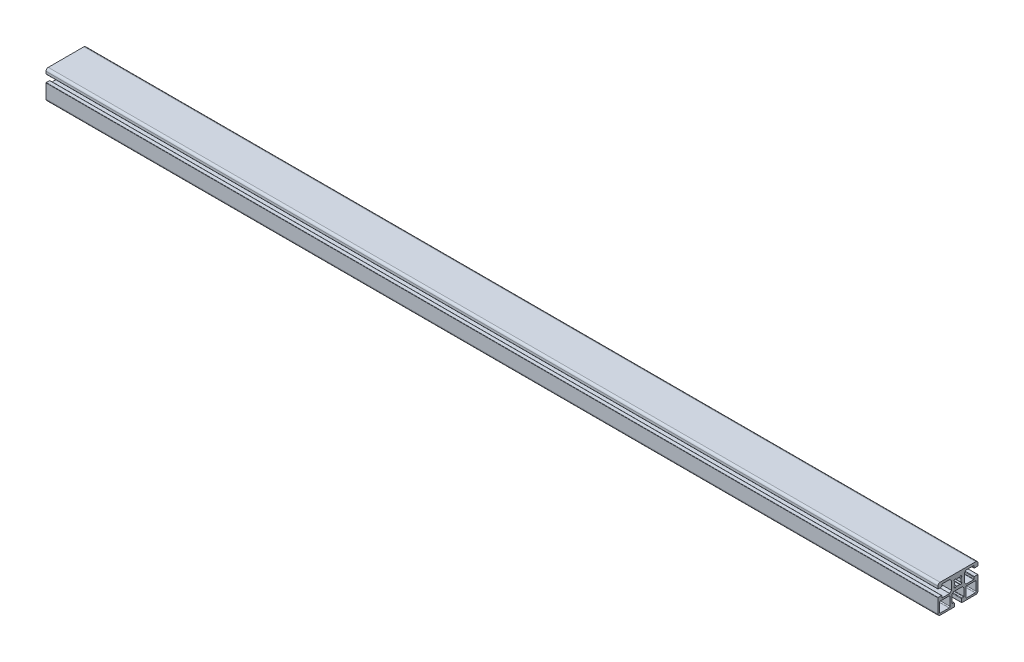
from build123d import *

# Parameters (mm, degrees)
F_45_SARJA_1_0072_ALUMIINIPROFIILI_45X32_L_DEPTH = 1000


with BuildPart() as part:
    # Sketch12 → 45-sarja 1.0072 ALUMIINIPROFIILI 45X32 L (new body)
    with BuildSketch(Plane(origin=(0, 0, 0), x_dir=(0, 0, -1), z_dir=(1, 0, 0))):
        with BuildLine():
            Line((18.763883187, 10.40208761), (22.463883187, 10.40208761))
            ThreePointArc((22.463883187, 10.40208761), (22.676015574, 10.489955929), (22.763883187, 10.70208861))
            Line((22.763883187, 10.70208861), (22.763883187, 13.30208761))
            ThreePointArc((22.763883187, 13.30208761), (22.03165014, 15.069854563), (20.263883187, 15.80208761))
            Line((20.263883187, 15.80208761), (-19.736116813, 15.80208761))
            ThreePointArc((-19.736116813, 15.80208761), (-21.503883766, 15.069854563), (-22.236116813, 13.30208761))
            Line((-22.236116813, 13.30208761), (-22.236116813, 10.70208761))
            ThreePointArc((-22.236116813, 10.70208761), (-22.148248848, 10.489955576), (-21.936116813, 10.40208761))
            Line((-21.936116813, 10.40208761), (-18.236116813, 10.40208761))
            ThreePointArc((-18.236116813, 10.40208761), (-17.882563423, 10.54853422), (-17.736116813, 10.90208761))
            Line((-17.736116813, 10.90208761), (-17.736116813, 12.80208761))
            ThreePointArc((-17.736116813, 12.80208761), (-17.648248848, 13.014219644), (-17.436116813, 13.10208761))
            Line((-17.436116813, 13.10208761), (-8.936116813, 13.10208761))
            Line((-8.936116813, 13.10208761), (-6.936116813, 11.10208661))
            Line((-6.936116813, 11.10208661), (-6.936116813, 1.50208861))
            Line((-6.936116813, 1.50208861), (-8.936116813, -0.49791239))
            Line((-8.936116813, -0.49791239), (-17.436116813, -0.49791239))
            ThreePointArc((-17.436116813, -0.49791239), (-17.648248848, -0.410044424), (-17.736116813, -0.19791239))
            Line((-17.736116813, -0.19791239), (-17.736116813, 1.70208761))
            ThreePointArc((-17.736116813, 1.70208761), (-17.882563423, 2.055641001), (-18.236116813, 2.20208761))
            Line((-18.236116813, 2.20208761), (-21.936116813, 2.20208761))
            ThreePointArc((-21.936116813, 2.20208761), (-22.148248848, 2.114219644), (-22.236116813, 1.90208761))
            Line((-22.236116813, 1.90208761), (-22.236116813, -13.69791239))
            ThreePointArc((-22.236116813, -13.69791239), (-21.503883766, -15.465679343), (-19.736116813, -16.19791239))
            Line((-19.736116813, -16.19791239), (-4.136116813, -16.19791239))
            ThreePointArc((-4.136116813, -16.19791239), (-3.923984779, -16.110044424), (-3.836116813, -15.89791239))
            Line((-3.836116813, -15.89791239), (-3.836116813, -12.19791239))
            ThreePointArc((-3.836116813, -12.19791239), (-3.982563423, -11.844358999), (-4.336116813, -11.69791239))
            Line((-4.336116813, -11.69791239), (-6.236116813, -11.69791239))
            ThreePointArc((-6.236116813, -11.69791239), (-6.448248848, -11.610044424), (-6.536116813, -11.39791239))
            Line((-6.536116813, -11.39791239), (-6.536116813, -2.89791239))
            Line((-6.536116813, -2.89791239), (-4.536115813, -0.89791239))
            Line((-4.536115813, -0.89791239), (5.063882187, -0.89791239))
            Line((5.063882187, -0.89791239), (7.063883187, -2.89791239))
            Line((7.063883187, -2.89791239), (7.063883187, -11.39791239))
            ThreePointArc((7.063883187, -11.39791239), (6.976015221, -11.610044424), (6.763883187, -11.69791239))
            Line((6.763883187, -11.69791239), (4.863883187, -11.69791239))
            ThreePointArc((4.863883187, -11.69791239), (4.510329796, -11.844358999), (4.363883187, -12.19791239))
            Line((4.363883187, -12.19791239), (4.363883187, -15.89791239))
            ThreePointArc((4.363883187, -15.89791239), (4.451751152, -16.110044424), (4.663883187, -16.19791239))
            Line((4.663883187, -16.19791239), (20.263883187, -16.19791239))
            ThreePointArc((20.263883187, -16.19791239), (22.03165014, -15.465679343), (22.763883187, -13.69791239))
            Line((22.763883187, -13.69791239), (22.763883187, 1.90208761))
            ThreePointArc((22.763883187, 1.90208761), (22.676015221, 2.114219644), (22.463883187, 2.20208761))
            Line((22.463883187, 2.20208761), (18.763883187, 2.20208761))
            ThreePointArc((18.763883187, 2.20208761), (18.410329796, 2.055641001), (18.263883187, 1.70208761))
            Line((18.263883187, 1.70208761), (18.263883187, -0.19791239))
            ThreePointArc((18.263883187, -0.19791239), (18.176015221, -0.410044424), (17.963883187, -0.49791239))
            Line((17.963883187, -0.49791239), (9.463884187, -0.49791239))
            Line((9.463884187, -0.49791239), (7.463883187, 1.50208961))
            Line((7.463883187, 1.50208961), (7.463883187, 11.10208661))
            Line((7.463883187, 11.10208661), (9.463884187, 13.10208761))
            Line((9.463884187, 13.10208761), (17.963883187, 13.10208761))
            ThreePointArc((17.963883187, 13.10208761), (18.176015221, 13.014219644), (18.263883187, 12.80208761))
            Line((18.263883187, 12.80208761), (18.263883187, 10.90208861))
            ThreePointArc((18.263883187, 10.90208861), (18.410329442, 10.548534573), (18.763883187, 10.40208761))
        make_face()
        with BuildLine():
            Line((-9.536116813, -2.49791239), (-19.236116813, -2.49791239))
            ThreePointArc((-19.236116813, -2.49791239), (-19.943223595, -2.790805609), (-20.236116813, -3.49791239))
            Line((-20.236116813, -3.49791239), (-20.236116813, -13.19791239))
            ThreePointArc((-20.236116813, -13.19791239), (-19.943223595, -13.905019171), (-19.236116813, -14.19791239))
            Line((-19.236116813, -14.19791239), (-9.536116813, -14.19791239))
            ThreePointArc((-9.536116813, -14.19791239), (-8.829010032, -13.905019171), (-8.536116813, -13.19791239))
            Line((-8.536116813, -13.19791239), (-8.536116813, -3.49791239))
            ThreePointArc((-8.536116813, -3.49791239), (-8.829010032, -2.790805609), (-9.536116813, -2.49791239))
        make_face(mode=Mode.SUBTRACT)
        with BuildLine():
            Line((19.727381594, -2.49791239), (10.027381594, -2.49791239))
            ThreePointArc((10.027381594, -2.49791239), (9.343755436, -2.803404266), (9.063883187, -3.49791239))
            Line((9.063883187, -3.49791239), (9.063883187, -13.19791239))
            ThreePointArc((9.063883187, -13.19791239), (9.343755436, -13.892420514), (10.027381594, -14.19791239))
            Line((10.027381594, -14.19791239), (19.727381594, -14.19791239))
            ThreePointArc((19.727381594, -14.19791239), (20.458204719, -13.918243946), (20.763883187, -13.19791239))
            Line((20.763883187, -13.19791239), (20.763883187, -3.49791239))
            ThreePointArc((20.763883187, -3.49791239), (20.458204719, -2.777580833), (19.727381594, -2.49791239))
        make_face(mode=Mode.SUBTRACT)
        with BuildLine():
            Line((-4.120178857, 2.90797506), (-3.130229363, 1.918025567))
            ThreePointArc((-3.130229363, 1.918025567), (-2.918097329, 1.830157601), (-2.705965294, 1.918025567))
            Line((-2.705965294, 1.918025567), (-1.685193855, 2.938797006))
            ThreePointArc((-1.685193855, 2.938797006), (-1.522807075, 3.022511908), (-1.341971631, 2.99650819))
            ThreePointArc((-1.341971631, 2.99650819), (0.263883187, 2.62708761), (1.869738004, 2.99650819))
            ThreePointArc((1.869738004, 2.99650819), (2.050573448, 3.022511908), (2.212960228, 2.938797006))
            Line((2.212960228, 2.938797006), (3.233731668, 1.918025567))
            ThreePointArc((3.233731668, 1.918025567), (3.445863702, 1.830157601), (3.657995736, 1.918025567))
            Line((3.657995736, 1.918025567), (4.64794523, 2.90797506))
            ThreePointArc((4.64794523, 2.90797506), (4.735813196, 3.120107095), (4.64794523, 3.332239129))
            Line((4.64794523, 3.332239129), (3.471552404, 4.508631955))
            ThreePointArc((3.471552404, 4.508631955), (3.937359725, 6.196280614), (3.569462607, 7.907942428))
            ThreePointArc((3.569462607, 7.907942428), (3.543458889, 8.088777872), (3.62717379, 8.251164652))
            Line((3.62717379, 8.251164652), (4.64794523, 9.271936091))
            ThreePointArc((4.64794523, 9.271936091), (4.735813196, 9.484068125), (4.64794523, 9.69620016))
            Line((4.64794523, 9.69620016), (3.657995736, 10.686149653))
            ThreePointArc((3.657995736, 10.686149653), (3.445863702, 10.774017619), (3.233731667, 10.686149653))
            Line((3.233731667, 10.686149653), (2.212960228, 9.665378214))
            ThreePointArc((2.212960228, 9.665378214), (2.050573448, 9.581663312), (1.869738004, 9.60766703))
            ThreePointArc((1.869738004, 9.60766703), (0.263883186, 9.97708761), (-1.341971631, 9.60766703))
            ThreePointArc((-1.341971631, 9.60766703), (-1.522807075, 9.581663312), (-1.685193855, 9.665378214))
            Line((-1.685193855, 9.665378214), (-2.705965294, 10.686149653))
            ThreePointArc((-2.705965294, 10.686149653), (-2.918097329, 10.774017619), (-3.130229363, 10.686149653))
            Line((-3.130229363, 10.686149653), (-4.120178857, 9.69620016))
            ThreePointArc((-4.120178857, 9.69620016), (-4.208046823, 9.484068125), (-4.120178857, 9.271936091))
            Line((-4.120178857, 9.271936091), (-3.099407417, 8.251164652))
            ThreePointArc((-3.099407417, 8.251164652), (-3.015692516, 8.088777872), (-3.041696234, 7.907942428))
            ThreePointArc((-3.041696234, 7.907942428), (-3.411116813, 6.30208761), (-3.041696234, 4.696232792))
            ThreePointArc((-3.041696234, 4.696232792), (-3.015692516, 4.515397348), (-3.099407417, 4.353010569))
            Line((-3.099407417, 4.353010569), (-4.120178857, 3.332239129))
            ThreePointArc((-4.120178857, 3.332239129), (-4.208046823, 3.120107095), (-4.120178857, 2.90797506))
        make_face(mode=Mode.SUBTRACT)
    extrude(amount=F_45_SARJA_1_0072_ALUMIINIPROFIILI_45X32_L_DEPTH)


solid = part.part
